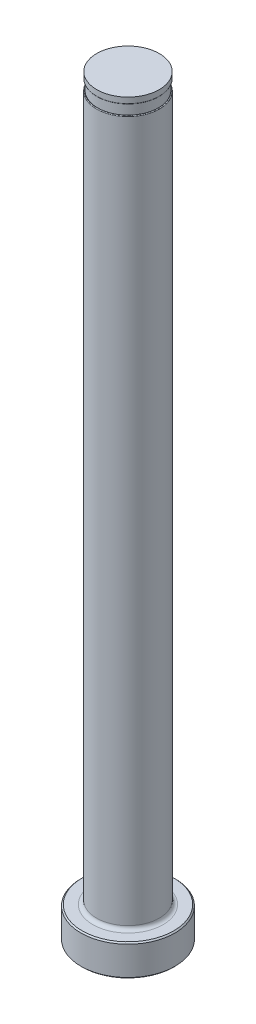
ISO-10303-21;
HEADER;
FILE_DESCRIPTION(('STEP AP214'),'2;1');
FILE_NAME('part.step','',(''),(''),'','','');
FILE_SCHEMA(('AUTOMOTIVE_DESIGN { 1 0 10303 214 1 1 1 1 }'));
ENDSEC;
DATA;
#1=APPLICATION_CONTEXT('core data for automotive mechanical design processes');
#2=APPLICATION_PROTOCOL_DEFINITION('international standard','automotive_design',2000,#1);
#3=PRODUCT_CONTEXT('',#1,'mechanical');
#4=PRODUCT('Part','Part','',(#3));
#5=PRODUCT_RELATED_PRODUCT_CATEGORY('part','',(#4));
#6=PRODUCT_DEFINITION_FORMATION('','',#4);
#7=PRODUCT_DEFINITION_CONTEXT('part definition',#1,'design');
#8=PRODUCT_DEFINITION('design','',#6,#7);
#9=PRODUCT_DEFINITION_SHAPE('','',#8);
#10=(LENGTH_UNIT() NAMED_UNIT(*) SI_UNIT(.MILLI.,.METRE.));
#11=(NAMED_UNIT(*) PLANE_ANGLE_UNIT() SI_UNIT($,.RADIAN.));
#12=(NAMED_UNIT(*) SI_UNIT($,.STERADIAN.) SOLID_ANGLE_UNIT());
#13=UNCERTAINTY_MEASURE_WITH_UNIT(LENGTH_MEASURE(1.E-05),#10,'distance_accuracy_value','');
#14=(GEOMETRIC_REPRESENTATION_CONTEXT(3) GLOBAL_UNCERTAINTY_ASSIGNED_CONTEXT((#13)) GLOBAL_UNIT_ASSIGNED_CONTEXT((#10,
#11,#12)) REPRESENTATION_CONTEXT('',''));
#15=CARTESIAN_POINT('',(0.,0.,0.));
#16=DIRECTION('',(0.,0.,1.));
#17=DIRECTION('',(1.,0.,0.));
#18=AXIS2_PLACEMENT_3D('',#15,#16,#17);
#19=CARTESIAN_POINT('',(-6.34999999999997,151.13,0.));
#20=DIRECTION('',(0.,1.,0.));
#21=DIRECTION('',(0.,0.,1.));
#22=AXIS2_PLACEMENT_3D('',#19,#20,#21);
#23=PLANE('',#22);
#24=CARTESIAN_POINT('',(0.,151.13,0.));
#25=DIRECTION('',(0.,1.,0.));
#26=DIRECTION('',(0.,0.,1.));
#27=AXIS2_PLACEMENT_3D('',#24,#25,#26);
#28=CIRCLE('',#27,6.21029999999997);
#29=CARTESIAN_POINT('',(0.,151.13,6.21029999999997));
#30=VERTEX_POINT('',#29);
#31=EDGE_CURVE('E11',#30,#30,#28,.F.);
#32=ORIENTED_EDGE('',*,*,#31,.T.);
#33=EDGE_LOOP('',(#32));
#34=FACE_BOUND('',#33,.T.);
#35=CARTESIAN_POINT('',(0.,151.13,0.));
#36=DIRECTION('',(0.,1.,0.));
#37=DIRECTION('',(0.,0.,1.));
#38=AXIS2_PLACEMENT_3D('',#35,#36,#37);
#39=CIRCLE('',#38,6.14679999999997);
#40=CARTESIAN_POINT('',(0.,151.13,6.14679999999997));
#41=VERTEX_POINT('',#40);
#42=EDGE_CURVE('E78',#41,#41,#39,.T.);
#43=ORIENTED_EDGE('',*,*,#42,.T.);
#44=EDGE_LOOP('',(#43));
#45=FACE_BOUND('',#44,.T.);
#46=ADVANCED_FACE('F36',(#34,#45),#23,.F.);
#47=CARTESIAN_POINT('',(0.,259.958771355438,0.));
#48=DIRECTION('',(0.,1.,0.));
#49=DIRECTION('',(0.,0.,1.));
#50=AXIS2_PLACEMENT_3D('',#47,#48,#49);
#51=CYLINDRICAL_SURFACE('',#50,6.34999999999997);
#52=DIRECTION('',(0.,1.,0.));
#53=VECTOR('',#52,1.);
#54=CARTESIAN_POINT('',(-6.14679999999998,259.958771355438,-1.59353373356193));
#55=LINE('',#54,#53);
#56=CARTESIAN_POINT('',(-6.14679999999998,148.971,-1.59353373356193));
#57=VERTEX_POINT('',#56);
#58=CARTESIAN_POINT('',(-6.14679999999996,86.614,-1.59353373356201));
#59=VERTEX_POINT('',#58);
#60=EDGE_CURVE('E73',#57,#59,#55,.F.);
#61=ORIENTED_EDGE('',*,*,#60,.F.);
#62=CARTESIAN_POINT('',(0.,148.971,0.));
#63=DIRECTION('',(0.,-1.,0.));
#64=DIRECTION('',(0.,0.,-1.));
#65=AXIS2_PLACEMENT_3D('',#62,#63,#64);
#66=CIRCLE('',#65,6.34999999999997);
#67=CARTESIAN_POINT('',(-6.14679999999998,148.971,1.59353373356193));
#68=VERTEX_POINT('',#67);
#69=EDGE_CURVE('E51',#57,#68,#66,.T.);
#70=ORIENTED_EDGE('',*,*,#69,.T.);
#71=DIRECTION('',(0.,1.,0.));
#72=VECTOR('',#71,1.);
#73=CARTESIAN_POINT('',(-6.14679999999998,259.958771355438,1.59353373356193));
#74=LINE('',#73,#72);
#75=CARTESIAN_POINT('',(-6.14679999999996,86.614,1.59353373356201));
#76=VERTEX_POINT('',#75);
#77=EDGE_CURVE('E84',#76,#68,#74,.T.);
#78=ORIENTED_EDGE('',*,*,#77,.F.);
#79=CARTESIAN_POINT('',(-6.14679999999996,86.614,-1.59353373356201));
#80=CARTESIAN_POINT('',(-6.14679686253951,86.5864663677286,-1.59353938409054));
#81=CARTESIAN_POINT('',(-6.14715862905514,86.5589529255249,-1.59215087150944));
#82=CARTESIAN_POINT('',(-6.14858031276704,86.5042441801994,-1.58665454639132));
#83=CARTESIAN_POINT('',(-6.1496395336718,86.4770485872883,-1.58254944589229));
#84=CARTESIAN_POINT('',(-6.15378495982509,86.3968935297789,-1.56638373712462));
#85=CARTESIAN_POINT('',(-6.15784047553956,86.3447192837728,-1.55046902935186));
#86=CARTESIAN_POINT('',(-6.16796669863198,86.2445368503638,-1.50967436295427));
#87=CARTESIAN_POINT('',(-6.17403041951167,86.1965149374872,-1.48482546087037));
#88=CARTESIAN_POINT('',(-6.18749023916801,86.1052134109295,-1.42770042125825));
#89=CARTESIAN_POINT('',(-6.19488985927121,86.0619468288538,-1.39540459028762));
#90=CARTESIAN_POINT('',(-6.2128308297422,85.9675154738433,-1.31357934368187));
#91=CARTESIAN_POINT('',(-6.22361527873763,85.9183096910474,-1.26185217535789));
#92=CARTESIAN_POINT('',(-6.24504791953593,85.8289285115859,-1.15112070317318));
#93=CARTESIAN_POINT('',(-6.25569585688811,85.7887681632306,-1.09210452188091));
#94=CARTESIAN_POINT('',(-6.27981252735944,85.703163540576,-0.94543699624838));
#95=CARTESIAN_POINT('',(-6.29280304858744,85.661570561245,-0.855464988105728));
#96=CARTESIAN_POINT('',(-6.3152685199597,85.59288021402,-0.669832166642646));
#97=CARTESIAN_POINT('',(-6.32474033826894,85.5657957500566,-0.574166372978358));
#98=CARTESIAN_POINT('',(-6.33958312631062,85.5242724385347,-0.377105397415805));
#99=CARTESIAN_POINT('',(-6.34483489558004,85.510199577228,-0.275625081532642));
#100=CARTESIAN_POINT('',(-6.35041977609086,85.4952595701,-0.0715187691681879));
#101=CARTESIAN_POINT('',(-6.35074885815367,85.494403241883,0.031108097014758));
#102=CARTESIAN_POINT('',(-6.34600640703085,85.5070416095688,0.256717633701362));
#103=CARTESIAN_POINT('',(-6.33980431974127,85.5235397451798,0.379522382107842));
#104=CARTESIAN_POINT('',(-6.32079279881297,85.576979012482,0.620117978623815));
#105=CARTESIAN_POINT('',(-6.30799326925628,85.6138895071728,0.737916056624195));
#106=CARTESIAN_POINT('',(-6.28320612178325,85.6928252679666,0.921417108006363));
#107=CARTESIAN_POINT('',(-6.27266140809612,85.7279385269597,0.990304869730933));
#108=CARTESIAN_POINT('',(-6.25047734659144,85.8081826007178,1.12180209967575));
#109=CARTESIAN_POINT('',(-6.23883987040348,85.8532964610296,1.18442193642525));
#110=CARTESIAN_POINT('',(-6.21836351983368,85.9425218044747,1.28706750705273));
#111=CARTESIAN_POINT('',(-6.20949901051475,85.9844586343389,1.32897137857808));
#112=CARTESIAN_POINT('',(-6.19260904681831,86.074662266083,1.40556985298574));
#113=CARTESIAN_POINT('',(-6.18458268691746,86.1229221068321,1.44027227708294));
#114=CARTESIAN_POINT('',(-6.17157345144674,86.215899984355,1.49493371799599));
#115=CARTESIAN_POINT('',(-6.16630262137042,86.2596744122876,1.51642497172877));
#116=CARTESIAN_POINT('',(-6.1574469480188,86.3502717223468,1.55199425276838));
#117=CARTESIAN_POINT('',(-6.15385883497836,86.3970884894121,1.56608666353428));
#118=CARTESIAN_POINT('',(-6.14982923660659,86.4725672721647,1.58181403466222));
#119=CARTESIAN_POINT('',(-6.14869942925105,86.5006434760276,1.58619374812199));
#120=CARTESIAN_POINT('',(-6.14718237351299,86.5571398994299,1.59205902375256));
#121=CARTESIAN_POINT('',(-6.14679576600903,86.5855603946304,1.59354208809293));
#122=CARTESIAN_POINT('',(-6.14679999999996,86.614,1.59353373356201));
#123=B_SPLINE_CURVE_WITH_KNOTS('',3,(#79,#80,#81,#82,#83,#84,#85,#86,#87,#88,#89,#90,#91,#92,
#93,#94,#95,#96,#97,#98,#99,#100,#101,#102,#103,#104,#105,#106,#107,#108,#109,#110,#111,#112,
#113,#114,#115,#116,#117,#118,#119,#120,#121,#122),.UNSPECIFIED.,.F.,.F.,(4,2,2,2,2,2,2,2,2,2,2,
2,2,2,2,2,2,2,2,2,2,4),(0.,0.0825255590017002,0.164968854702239,0.327951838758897,
0.490373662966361,0.653230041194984,0.868657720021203,1.08444118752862,1.38273372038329,
1.68129111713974,1.9880112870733,2.29498249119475,2.66541500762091,3.0352930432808,
3.2686988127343,3.50171186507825,3.68091203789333,3.85991655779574,4.00647458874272,
4.15274664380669,4.23791544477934,4.32315765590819),.UNSPECIFIED.);
#124=EDGE_CURVE('E81',#59,#76,#123,.T.);
#125=ORIENTED_EDGE('',*,*,#124,.F.);
#126=EDGE_LOOP('',(#61,#70,#78,#125));
#127=FACE_BOUND('',#126,.T.);
#128=CARTESIAN_POINT('',(0.,7.11200000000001,0.));
#129=DIRECTION('',(0.,1.,0.));
#130=DIRECTION('',(0.,0.,1.));
#131=AXIS2_PLACEMENT_3D('',#128,#129,#130);
#132=CIRCLE('',#131,6.34999999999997);
#133=CARTESIAN_POINT('',(0.,7.11200000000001,6.34999999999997));
#134=VERTEX_POINT('',#133);
#135=EDGE_CURVE('E116',#134,#134,#132,.T.);
#136=ORIENTED_EDGE('',*,*,#135,.T.);
#137=EDGE_LOOP('',(#136));
#138=FACE_BOUND('',#137,.T.);
#139=ADVANCED_FACE('F82',(#127,#138),#51,.T.);
#140=CARTESIAN_POINT('',(0.,0.,0.));
#141=DIRECTION('',(0.,-1.,0.));
#142=DIRECTION('',(0.,0.,-1.));
#143=AXIS2_PLACEMENT_3D('',#140,#141,#142);
#144=PLANE('',#143);
#145=CARTESIAN_POINT('',(0.,0.,0.));
#146=DIRECTION('',(0.,-1.,0.));
#147=DIRECTION('',(0.,0.,-1.));
#148=AXIS2_PLACEMENT_3D('',#145,#146,#147);
#149=CIRCLE('',#148,9.271);
#150=CARTESIAN_POINT('',(0.,0.,-9.271));
#151=VERTEX_POINT('',#150);
#152=EDGE_CURVE('E113',#151,#151,#149,.T.);
#153=ORIENTED_EDGE('',*,*,#152,.T.);
#154=EDGE_LOOP('',(#153));
#155=FACE_BOUND('',#154,.T.);
#156=ADVANCED_FACE('F192',(#155),#144,.T.);
#157=CARTESIAN_POINT('',(0.,259.958771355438,0.));
#158=DIRECTION('',(0.,1.,0.));
#159=DIRECTION('',(0.,0.,1.));
#160=AXIS2_PLACEMENT_3D('',#157,#158,#159);
#161=CYLINDRICAL_SURFACE('',#160,9.52499999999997);
#162=CARTESIAN_POINT('',(0.,6.09600000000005,0.));
#163=DIRECTION('',(0.,1.,0.));
#164=DIRECTION('',(0.,0.,1.));
#165=AXIS2_PLACEMENT_3D('',#162,#163,#164);
#166=CIRCLE('',#165,9.52499999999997);
#167=CARTESIAN_POINT('',(0.,6.09600000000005,9.52499999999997));
#168=VERTEX_POINT('',#167);
#169=EDGE_CURVE('E110',#168,#168,#166,.F.);
#170=ORIENTED_EDGE('',*,*,#169,.T.);
#171=EDGE_LOOP('',(#170));
#172=FACE_BOUND('',#171,.T.);
#173=CARTESIAN_POINT('',(0.,0.253999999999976,0.));
#174=DIRECTION('',(0.,-1.,0.));
#175=DIRECTION('',(0.,0.,-1.));
#176=AXIS2_PLACEMENT_3D('',#173,#174,#175);
#177=CIRCLE('',#176,9.52499999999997);
#178=CARTESIAN_POINT('',(0.,0.253999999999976,-9.52499999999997));
#179=VERTEX_POINT('',#178);
#180=EDGE_CURVE('E107',#179,#179,#177,.F.);
#181=ORIENTED_EDGE('',*,*,#180,.T.);
#182=EDGE_LOOP('',(#181));
#183=FACE_BOUND('',#182,.T.);
#184=ADVANCED_FACE('F195',(#172,#183),#161,.T.);
#185=CARTESIAN_POINT('',(-9.52499999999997,6.35,0.));
#186=DIRECTION('',(0.,1.,0.));
#187=DIRECTION('',(0.,0.,1.));
#188=AXIS2_PLACEMENT_3D('',#185,#186,#187);
#189=PLANE('',#188);
#190=CARTESIAN_POINT('',(0.,6.35,0.));
#191=DIRECTION('',(0.,1.,0.));
#192=DIRECTION('',(0.,0.,1.));
#193=AXIS2_PLACEMENT_3D('',#190,#191,#192);
#194=CIRCLE('',#193,7.11199999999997);
#195=CARTESIAN_POINT('',(0.,6.35,7.11199999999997));
#196=VERTEX_POINT('',#195);
#197=EDGE_CURVE('E87',#196,#196,#194,.F.);
#198=ORIENTED_EDGE('',*,*,#197,.T.);
#199=EDGE_LOOP('',(#198));
#200=FACE_BOUND('',#199,.T.);
#201=CARTESIAN_POINT('',(0.,6.35,0.));
#202=DIRECTION('',(0.,1.,0.));
#203=DIRECTION('',(0.,0.,1.));
#204=AXIS2_PLACEMENT_3D('',#201,#202,#203);
#205=CIRCLE('',#204,9.27100000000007);
#206=CARTESIAN_POINT('',(0.,6.35,9.27100000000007));
#207=VERTEX_POINT('',#206);
#208=EDGE_CURVE('E104',#207,#207,#205,.T.);
#209=ORIENTED_EDGE('',*,*,#208,.T.);
#210=EDGE_LOOP('',(#209));
#211=FACE_BOUND('',#210,.T.);
#212=ADVANCED_FACE('F190',(#200,#211),#189,.T.);
#213=CARTESIAN_POINT('',(0.,6.35000000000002,0.));
#214=DIRECTION('',(0.,-1.,0.));
#215=DIRECTION('',(0.,0.,-1.));
#216=AXIS2_PLACEMENT_3D('',#213,#214,#215);
#217=CONICAL_SURFACE('',#216,9.27100000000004,0.785398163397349);
#218=ORIENTED_EDGE('',*,*,#169,.F.);
#219=EDGE_LOOP('',(#218));
#220=FACE_BOUND('',#219,.T.);
#221=ORIENTED_EDGE('',*,*,#208,.F.);
#222=EDGE_LOOP('',(#221));
#223=FACE_BOUND('',#222,.T.);
#224=ADVANCED_FACE('F186',(#220,#223),#217,.T.);
#225=CARTESIAN_POINT('',(0.,0.253999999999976,0.));
#226=DIRECTION('',(0.,1.,0.));
#227=DIRECTION('',(0.,0.,1.));
#228=AXIS2_PLACEMENT_3D('',#225,#226,#227);
#229=CONICAL_SURFACE('',#228,9.52499999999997,0.785398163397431);
#230=ORIENTED_EDGE('',*,*,#152,.F.);
#231=EDGE_LOOP('',(#230));
#232=FACE_BOUND('',#231,.T.);
#233=ORIENTED_EDGE('',*,*,#180,.F.);
#234=EDGE_LOOP('',(#233));
#235=FACE_BOUND('',#234,.T.);
#236=ADVANCED_FACE('F182',(#232,#235),#229,.T.);
#237=CARTESIAN_POINT('',(0.,7.11200000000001,0.));
#238=DIRECTION('',(0.,1.,0.));
#239=DIRECTION('',(0.,0.,1.));
#240=AXIS2_PLACEMENT_3D('',#237,#238,#239);
#241=TOROIDAL_SURFACE('',#240,7.11199999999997,0.762);
#242=ORIENTED_EDGE('',*,*,#197,.F.);
#243=EDGE_LOOP('',(#242));
#244=FACE_BOUND('',#243,.T.);
#245=ORIENTED_EDGE('',*,*,#135,.F.);
#246=EDGE_LOOP('',(#245));
#247=FACE_BOUND('',#246,.T.);
#248=ADVANCED_FACE('F147',(#244,#247),#241,.F.);
#249=CARTESIAN_POINT('',(-6.34999999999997,149.098,0.));
#250=DIRECTION('',(0.,-1.,0.));
#251=DIRECTION('',(0.,0.,-1.));
#252=AXIS2_PLACEMENT_3D('',#249,#250,#251);
#253=PLANE('',#252);
#254=DIRECTION('',(0.,0.,1.));
#255=VECTOR('',#254,1.);
#256=CARTESIAN_POINT('',(-6.14679999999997,149.098,0.));
#257=LINE('',#256,#255);
#258=CARTESIAN_POINT('',(-6.14679999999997,149.098,0.));
#259=VERTEX_POINT('',#258);
#260=CARTESIAN_POINT('',(-6.14679999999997,149.098,0.970864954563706));
#261=VERTEX_POINT('',#260);
#262=EDGE_CURVE('E90',#259,#261,#257,.T.);
#263=ORIENTED_EDGE('',*,*,#262,.T.);
#264=CARTESIAN_POINT('',(0.,149.098,0.));
#265=DIRECTION('',(0.,-1.,0.));
#266=DIRECTION('',(0.,0.,-1.));
#267=AXIS2_PLACEMENT_3D('',#264,#265,#266);
#268=CIRCLE('',#267,6.22299999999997);
#269=CARTESIAN_POINT('',(-6.14679999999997,149.098,-0.970864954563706));
#270=VERTEX_POINT('',#269);
#271=EDGE_CURVE('E86',#261,#270,#268,.F.);
#272=ORIENTED_EDGE('',*,*,#271,.T.);
#273=EDGE_CURVE('E79',#270,#259,#257,.T.);
#274=ORIENTED_EDGE('',*,*,#273,.T.);
#275=CARTESIAN_POINT('',(0.,149.098,0.));
#276=DIRECTION('',(0.,1.,0.));
#277=DIRECTION('',(0.,0.,1.));
#278=AXIS2_PLACEMENT_3D('',#275,#276,#277);
#279=CIRCLE('',#278,6.14679999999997);
#280=EDGE_CURVE('E101',#259,#259,#279,.T.);
#281=ORIENTED_EDGE('',*,*,#280,.F.);
#282=EDGE_LOOP('',(#263,#272,#274,#281));
#283=FACE_BOUND('',#282,.T.);
#284=ADVANCED_FACE('F144',(#283),#253,.F.);
#285=CARTESIAN_POINT('',(0.,153.448281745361,0.));
#286=DIRECTION('',(0.,1.,0.));
#287=DIRECTION('',(0.,0.,1.));
#288=AXIS2_PLACEMENT_3D('',#285,#286,#287);
#289=CYLINDRICAL_SURFACE('',#288,6.14679999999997);
#290=ORIENTED_EDGE('',*,*,#42,.F.);
#291=EDGE_LOOP('',(#290));
#292=FACE_BOUND('',#291,.T.);
#293=ORIENTED_EDGE('',*,*,#280,.T.);
#294=EDGE_LOOP('',(#293));
#295=FACE_BOUND('',#294,.T.);
#296=ADVANCED_FACE('F141',(#292,#295),#289,.T.);
#297=CARTESIAN_POINT('',(-6.14679999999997,150.114,-9.52499999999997));
#298=DIRECTION('',(1.,0.,0.));
#299=DIRECTION('',(0.,1.,0.));
#300=AXIS2_PLACEMENT_3D('',#297,#298,#299);
#301=PLANE('',#300);
#302=ORIENTED_EDGE('',*,*,#273,.F.);
#303=CARTESIAN_POINT('',(-6.14679999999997,149.098,-0.970864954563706));
#304=CARTESIAN_POINT('',(-6.14679999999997,149.097999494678,-0.99202805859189));
#305=CARTESIAN_POINT('',(-6.14679999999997,149.09787177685,-1.01319058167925));
#306=CARTESIAN_POINT('',(-6.14679999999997,149.097304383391,-1.05551642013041));
#307=CARTESIAN_POINT('',(-6.14679999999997,149.096864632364,-1.07667973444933));
#308=CARTESIAN_POINT('',(-6.14679999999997,149.09498930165,-1.14021803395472));
#309=CARTESIAN_POINT('',(-6.14679999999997,149.092997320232,-1.18258174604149));
#310=CARTESIAN_POINT('',(-6.14679999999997,149.08836583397,-1.24564697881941));
#311=CARTESIAN_POINT('',(-6.14679999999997,149.086570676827,-1.26640955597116));
#312=CARTESIAN_POINT('',(-6.14679999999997,149.082292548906,-1.30785556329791));
#313=CARTESIAN_POINT('',(-6.14679999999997,149.079809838,-1.32853902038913));
#314=CARTESIAN_POINT('',(-6.14679999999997,149.07286463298,-1.37752764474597));
#315=CARTESIAN_POINT('',(-6.14679999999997,149.068008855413,-1.40578261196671));
#316=CARTESIAN_POINT('',(-6.14679999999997,149.057486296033,-1.45315312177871));
#317=CARTESIAN_POINT('',(-6.14679999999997,149.052522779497,-1.47241873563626));
#318=CARTESIAN_POINT('',(-6.14679999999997,149.042243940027,-1.50466142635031));
#319=CARTESIAN_POINT('',(-6.14679999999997,149.037474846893,-1.51780066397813));
#320=CARTESIAN_POINT('',(-6.14679999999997,149.028759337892,-1.53746298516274));
#321=CARTESIAN_POINT('',(-6.14679999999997,149.025436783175,-1.54425972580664));
#322=CARTESIAN_POINT('',(-6.14679999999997,149.018050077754,-1.55743156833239));
#323=CARTESIAN_POINT('',(-6.14679999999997,149.013989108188,-1.56380832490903));
#324=CARTESIAN_POINT('',(-6.14679999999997,149.007517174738,-1.5720869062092));
#325=CARTESIAN_POINT('',(-6.14679999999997,149.005591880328,-1.57436448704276));
#326=CARTESIAN_POINT('',(-6.14679999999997,149.001512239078,-1.57872030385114));
#327=CARTESIAN_POINT('',(-6.14679999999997,148.999357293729,-1.58079799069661));
#328=CARTESIAN_POINT('',(-6.14679999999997,148.994744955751,-1.58467787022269));
#329=CARTESIAN_POINT('',(-6.14679999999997,148.992283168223,-1.58647496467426));
#330=CARTESIAN_POINT('',(-6.14679999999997,148.987073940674,-1.58956779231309));
#331=CARTESIAN_POINT('',(-6.14679999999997,148.984329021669,-1.59086753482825));
#332=CARTESIAN_POINT('',(-6.14679999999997,148.979789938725,-1.59236406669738));
#333=CARTESIAN_POINT('',(-6.14679999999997,148.978073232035,-1.5927947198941));
#334=CARTESIAN_POINT('',(-6.14679999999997,148.974573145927,-1.59338315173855));
#335=CARTESIAN_POINT('',(-6.14679999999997,148.972789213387,-1.59353759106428));
#336=CARTESIAN_POINT('',(-6.14679999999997,148.971,-1.59353373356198));
#337=B_SPLINE_CURVE_WITH_KNOTS('',3,(#303,#304,#305,#306,#307,#308,#309,#310,#311,#312,#313,
#314,#315,#316,#317,#318,#319,#320,#321,#322,#323,#324,#325,#326,#327,#328,#329,#330,#331,#332,
#333,#334,#335,#336),.UNSPECIFIED.,.F.,.F.,(4,2,2,2,2,2,2,2,2,2,2,2,2,2,2,2,4),(0.,
0.0634873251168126,0.126989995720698,0.254174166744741,0.316684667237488,0.379171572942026,
0.465088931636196,0.524705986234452,0.566546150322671,0.589220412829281,0.611799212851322,
0.620735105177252,0.629694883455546,0.638802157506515,0.647834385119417,0.653123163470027,
0.658475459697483),.UNSPECIFIED.);
#338=EDGE_CURVE('E59',#270,#57,#337,.T.);
#339=ORIENTED_EDGE('',*,*,#338,.T.);
#340=ORIENTED_EDGE('',*,*,#60,.T.);
#341=DIRECTION('',(0.,0.,1.));
#342=VECTOR('',#341,1.);
#343=CARTESIAN_POINT('',(-6.14679999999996,86.614,-9.52499999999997));
#344=LINE('',#343,#342);
#345=EDGE_CURVE('E77',#59,#76,#344,.T.);
#346=ORIENTED_EDGE('',*,*,#345,.T.);
#347=ORIENTED_EDGE('',*,*,#77,.T.);
#348=CARTESIAN_POINT('',(-6.14679999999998,148.971,1.59353373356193));
#349=CARTESIAN_POINT('',(-6.14679999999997,148.973212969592,1.59354190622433));
#350=CARTESIAN_POINT('',(-6.14679999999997,148.975413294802,1.59330365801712));
#351=CARTESIAN_POINT('',(-6.14679999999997,148.9796934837,1.59241515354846));
#352=CARTESIAN_POINT('',(-6.14679999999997,148.981774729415,1.59177170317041));
#353=CARTESIAN_POINT('',(-6.14679999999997,148.986264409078,1.58996085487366));
#354=CARTESIAN_POINT('',(-6.14679999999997,148.988636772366,1.58870654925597));
#355=CARTESIAN_POINT('',(-6.14679999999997,148.993163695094,1.58583480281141));
#356=CARTESIAN_POINT('',(-6.14679999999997,148.995316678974,1.58421497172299));
#357=CARTESIAN_POINT('',(-6.14679999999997,149.001009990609,1.57937157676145));
#358=CARTESIAN_POINT('',(-6.14679999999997,149.004321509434,1.57588310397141));
#359=CARTESIAN_POINT('',(-6.14679999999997,149.010438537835,1.56850014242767));
#360=CARTESIAN_POINT('',(-6.14679999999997,149.01324308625,1.56460490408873));
#361=CARTESIAN_POINT('',(-6.14679999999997,149.01993924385,1.55433442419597));
#362=CARTESIAN_POINT('',(-6.14679999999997,149.023564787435,1.54778763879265));
#363=CARTESIAN_POINT('',(-6.14679999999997,149.030209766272,1.5343888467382));
#364=CARTESIAN_POINT('',(-6.14679999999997,149.033227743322,1.527536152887));
#365=CARTESIAN_POINT('',(-6.14679999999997,149.041649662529,1.5066491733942));
#366=CARTESIAN_POINT('',(-6.14679999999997,149.046386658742,1.49234856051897));
#367=CARTESIAN_POINT('',(-6.14679999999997,149.054853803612,1.46319301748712));
#368=CARTESIAN_POINT('',(-6.14679999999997,149.058564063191,1.44833273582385));
#369=CARTESIAN_POINT('',(-6.14679999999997,149.065191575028,1.41843325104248));
#370=CARTESIAN_POINT('',(-6.14679999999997,149.068108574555,1.40339399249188));
#371=CARTESIAN_POINT('',(-6.14679999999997,149.075988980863,1.3580554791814));
#372=CARTESIAN_POINT('',(-6.14679999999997,149.080064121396,1.32760471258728));
#373=CARTESIAN_POINT('',(-6.14679999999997,149.086693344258,1.26653961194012));
#374=CARTESIAN_POINT('',(-6.14679999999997,149.089246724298,1.23592520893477));
#375=CARTESIAN_POINT('',(-6.14679999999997,149.093251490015,1.1746618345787));
#376=CARTESIAN_POINT('',(-6.14679999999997,149.094704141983,1.1440129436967));
#377=CARTESIAN_POINT('',(-6.14679999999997,149.096556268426,1.08956123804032));
#378=CARTESIAN_POINT('',(-6.14679999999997,149.097118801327,1.06576333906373));
#379=CARTESIAN_POINT('',(-6.14679999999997,149.09783839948,1.01826491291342));
#380=CARTESIAN_POINT('',(-6.14679999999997,149.097997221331,0.994564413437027));
#381=CARTESIAN_POINT('',(-6.14679999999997,149.098,0.970864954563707));
#382=B_SPLINE_CURVE_WITH_KNOTS('',3,(#348,#349,#350,#351,#352,#353,#354,#355,#356,#357,#358,
#359,#360,#361,#362,#363,#364,#365,#366,#367,#368,#369,#370,#371,#372,#373,#374,#375,#376,#377,
#378,#379,#380,#381),.UNSPECIFIED.,.F.,.F.,(4,2,2,2,2,2,2,2,2,2,2,2,2,2,2,2,4),(0.,
0.00660592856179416,0.0131037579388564,0.0211086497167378,0.0291674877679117,0.0435165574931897,
0.0578925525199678,0.0802861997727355,0.102732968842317,0.147839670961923,0.193767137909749,
0.239709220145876,0.331806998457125,0.423947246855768,0.515981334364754,0.587391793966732,
0.658491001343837),.UNSPECIFIED.);
#383=EDGE_CURVE('E172',#68,#261,#382,.T.);
#384=ORIENTED_EDGE('',*,*,#383,.T.);
#385=ORIENTED_EDGE('',*,*,#262,.F.);
#386=EDGE_LOOP('',(#302,#339,#340,#346,#347,#384,#385));
#387=FACE_BOUND('',#386,.T.);
#388=ADVANCED_FACE('F75',(#387),#301,.F.);
#389=CARTESIAN_POINT('',(-9.32179999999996,86.614,-9.52499999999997));
#390=DIRECTION('',(0.,0.,1.));
#391=DIRECTION('',(1.,0.,0.));
#392=AXIS2_PLACEMENT_3D('',#389,#390,#391);
#393=CYLINDRICAL_SURFACE('',#392,3.175);
#394=ORIENTED_EDGE('',*,*,#345,.F.);
#395=ORIENTED_EDGE('',*,*,#124,.T.);
#396=EDGE_LOOP('',(#394,#395));
#397=FACE_BOUND('',#396,.T.);
#398=ADVANCED_FACE('F89',(#397),#393,.F.);
#399=CARTESIAN_POINT('',(0.,152.687735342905,0.));
#400=DIRECTION('',(0.,1.,0.));
#401=DIRECTION('',(0.,0.,1.));
#402=AXIS2_PLACEMENT_3D('',#399,#400,#401);
#403=CYLINDRICAL_SURFACE('',#402,6.33729999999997);
#404=CARTESIAN_POINT('',(0.,151.257,0.));
#405=DIRECTION('',(0.,1.,0.));
#406=DIRECTION('',(0.,0.,1.));
#407=AXIS2_PLACEMENT_3D('',#404,#405,#406);
#408=CIRCLE('',#407,6.33729999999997);
#409=CARTESIAN_POINT('',(0.,151.257,6.33729999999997));
#410=VERTEX_POINT('',#409);
#411=EDGE_CURVE('E44',#410,#410,#408,.T.);
#412=ORIENTED_EDGE('',*,*,#411,.T.);
#413=EDGE_LOOP('',(#412));
#414=FACE_BOUND('',#413,.T.);
#415=CARTESIAN_POINT('',(0.,152.4,0.));
#416=DIRECTION('',(0.,1.,0.));
#417=DIRECTION('',(0.,0.,1.));
#418=AXIS2_PLACEMENT_3D('',#415,#416,#417);
#419=CIRCLE('',#418,6.33729999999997);
#420=CARTESIAN_POINT('',(0.,152.4,6.33729999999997));
#421=VERTEX_POINT('',#420);
#422=EDGE_CURVE('E91',#421,#421,#419,.T.);
#423=ORIENTED_EDGE('',*,*,#422,.F.);
#424=EDGE_LOOP('',(#423));
#425=FACE_BOUND('',#424,.T.);
#426=ADVANCED_FACE('F135',(#414,#425),#403,.T.);
#427=CARTESIAN_POINT('',(-6.34999999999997,152.4,0.));
#428=DIRECTION('',(0.,1.,0.));
#429=DIRECTION('',(0.,0.,1.));
#430=AXIS2_PLACEMENT_3D('',#427,#428,#429);
#431=PLANE('',#430);
#432=ORIENTED_EDGE('',*,*,#422,.T.);
#433=EDGE_LOOP('',(#432));
#434=FACE_BOUND('',#433,.T.);
#435=ADVANCED_FACE('F149',(#434),#431,.T.);
#436=CARTESIAN_POINT('',(0.,148.971,0.));
#437=DIRECTION('',(0.,-1.,0.));
#438=DIRECTION('',(0.,0.,-1.));
#439=AXIS2_PLACEMENT_3D('',#436,#437,#438);
#440=TOROIDAL_SURFACE('',#439,6.22299999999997,0.127);
#441=ORIENTED_EDGE('',*,*,#383,.F.);
#442=ORIENTED_EDGE('',*,*,#69,.F.);
#443=ORIENTED_EDGE('',*,*,#338,.F.);
#444=ORIENTED_EDGE('',*,*,#271,.F.);
#445=EDGE_LOOP('',(#441,#442,#443,#444));
#446=FACE_BOUND('',#445,.T.);
#447=ADVANCED_FACE('F151',(#446),#440,.T.);
#448=CARTESIAN_POINT('',(0.,151.257,0.));
#449=DIRECTION('',(0.,1.,0.));
#450=DIRECTION('',(0.,0.,1.));
#451=AXIS2_PLACEMENT_3D('',#448,#449,#450);
#452=TOROIDAL_SURFACE('',#451,6.21029999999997,0.127);
#453=ORIENTED_EDGE('',*,*,#31,.F.);
#454=EDGE_LOOP('',(#453));
#455=FACE_BOUND('',#454,.T.);
#456=ORIENTED_EDGE('',*,*,#411,.F.);
#457=EDGE_LOOP('',(#456));
#458=FACE_BOUND('',#457,.T.);
#459=ADVANCED_FACE('F38',(#455,#458),#452,.T.);
#460=CLOSED_SHELL('',(#46,#139,#156,#184,#212,#224,#236,#248,#284,#296,#388,#398,#426,#435,#447,#459));
#461=MANIFOLD_SOLID_BREP('B2',#460);
#462=ADVANCED_BREP_SHAPE_REPRESENTATION('',(#18,#461),#14);
#463=SHAPE_DEFINITION_REPRESENTATION(#9,#462);
ENDSEC;
END-ISO-10303-21;
